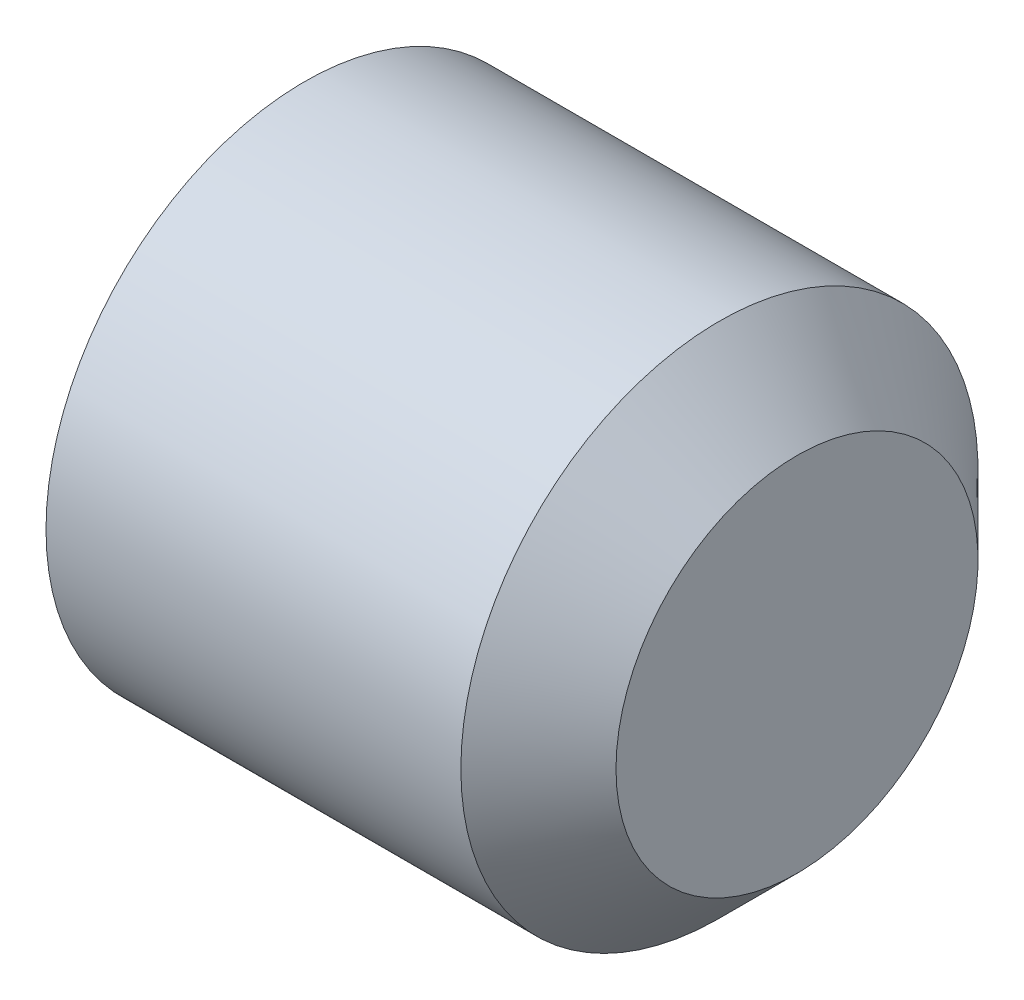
from build123d import *

# Parameters (mm, degrees)
HEX_2_DEPTH = 5


with BuildPart() as part:
    # BodySke → BaseBody (revolve)
    with BuildSketch(Plane.XY, mode=Mode.PRIVATE) as basebody_sk:
        Polygon((0, 0), (0, 4.172), (0.478046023, 5), (8.5, 5), (10, 3.5), (10, 0), align=None)
    revolve(basebody_sk.sketch.rotate(Axis((-12.7, 0, 0), (1, 0, 0)), 90), axis=Axis((-12.7, 0, 0), (1, 0, 0)))

    # Sketch2 → Hex 2 (cut)
    with BuildSketch(Plane.ZY):
        Polygon((1.443375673, 2.5), (-1.443375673, 2.5), (-2.886751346, 0), (-1.443375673, -2.5), (1.443375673, -2.5), (2.886751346, 0), align=None)
    extrude(amount=-HEX_2_DEPTH, mode=Mode.SUBTRACT)


solid = part.part
